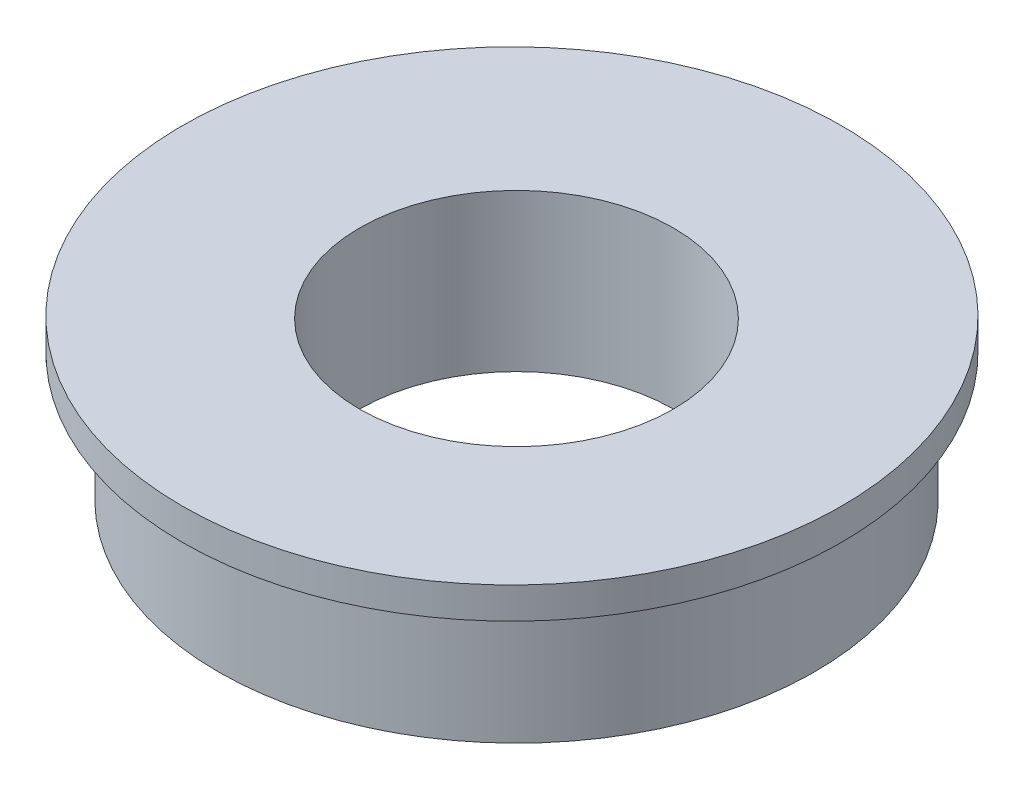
from build123d import *

# Parameters (mm, degrees)
SKETCH1_R           = 9.5
SKETCH1_R_2         = 5
BOSS_EXTRUDE1_DEPTH = 5
BOSS_EXTRUDE2_START = -1
SKETCH2_R           = 10.5
SKETCH2_R_2         = 5
BOSS_EXTRUDE2_DEPTH = 1


with BuildPart() as part:
    # Sketch1 → Boss-Extrude1 (new body)
    with BuildSketch(Plane(origin=(0, 0, 0), x_dir=(1, 0, 0), z_dir=(0, 1, 0))):
        with Locations(Location((0, 0, 0), (0, 0, 270))):
            Circle(SKETCH1_R)
        with Locations(Location((0, 0, 0), (0, 0, 270))):
            Circle(SKETCH1_R_2, mode=Mode.SUBTRACT)
    extrude(amount=BOSS_EXTRUDE1_DEPTH)

    # Sketch2 → Boss-Extrude2 (add)
    with BuildSketch(Plane(origin=(0, 5, 0), x_dir=(1, 0, 0), z_dir=(0, 1, 0)).offset(BOSS_EXTRUDE2_START)):
        with Locations(Location((-0.145329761, 0, 0), (0, 0, 270))):
            Circle(SKETCH2_R)
        with Locations(Location((0, 0, 0), (0, 0, 270))):
            Circle(SKETCH2_R_2, mode=Mode.SUBTRACT)
    extrude(amount=BOSS_EXTRUDE2_DEPTH)


solid = part.part
